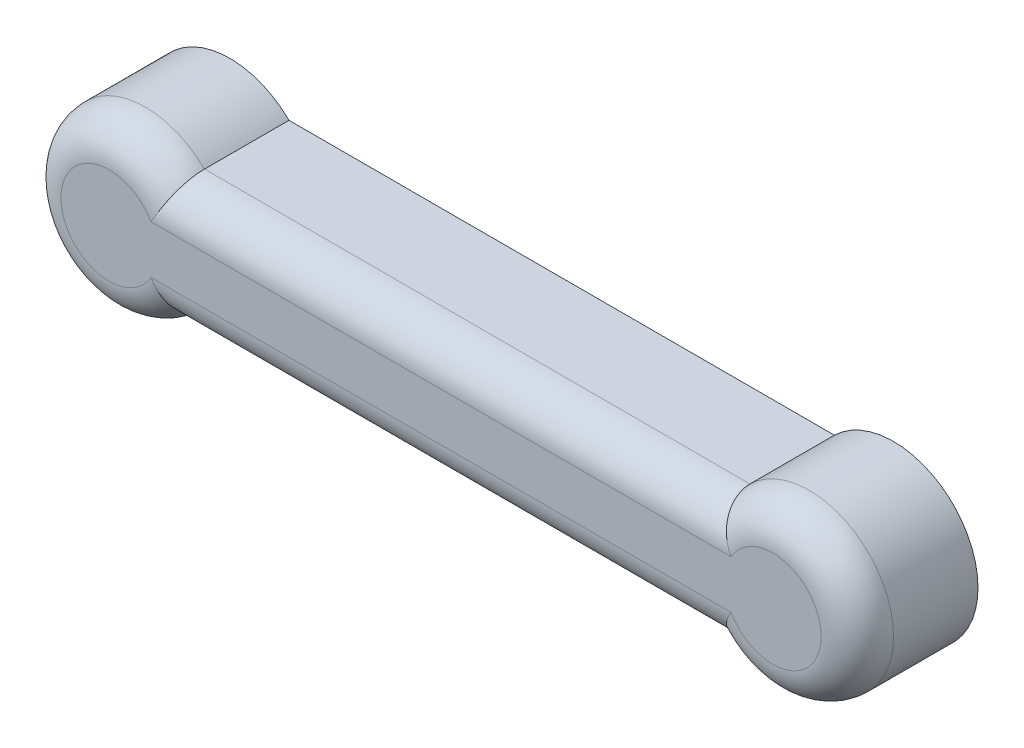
ISO-10303-21;
HEADER;
FILE_DESCRIPTION(('STEP AP214'),'2;1');
FILE_NAME('part.step','',(''),(''),'','','');
FILE_SCHEMA(('AUTOMOTIVE_DESIGN { 1 0 10303 214 1 1 1 1 }'));
ENDSEC;
DATA;
#1=APPLICATION_CONTEXT('core data for automotive mechanical design processes');
#2=APPLICATION_PROTOCOL_DEFINITION('international standard','automotive_design',2000,#1);
#3=PRODUCT_CONTEXT('',#1,'mechanical');
#4=PRODUCT('Part','Part','',(#3));
#5=PRODUCT_RELATED_PRODUCT_CATEGORY('part','',(#4));
#6=PRODUCT_DEFINITION_FORMATION('','',#4);
#7=PRODUCT_DEFINITION_CONTEXT('part definition',#1,'design');
#8=PRODUCT_DEFINITION('design','',#6,#7);
#9=PRODUCT_DEFINITION_SHAPE('','',#8);
#10=(LENGTH_UNIT() NAMED_UNIT(*) SI_UNIT(.MILLI.,.METRE.));
#11=(NAMED_UNIT(*) PLANE_ANGLE_UNIT() SI_UNIT($,.RADIAN.));
#12=(NAMED_UNIT(*) SI_UNIT($,.STERADIAN.) SOLID_ANGLE_UNIT());
#13=UNCERTAINTY_MEASURE_WITH_UNIT(LENGTH_MEASURE(1.E-05),#10,'distance_accuracy_value','');
#14=(GEOMETRIC_REPRESENTATION_CONTEXT(3) GLOBAL_UNCERTAINTY_ASSIGNED_CONTEXT((#13)) GLOBAL_UNIT_ASSIGNED_CONTEXT((#10,
#11,#12)) REPRESENTATION_CONTEXT('',''));
#15=CARTESIAN_POINT('',(0.,0.,0.));
#16=DIRECTION('',(0.,0.,1.));
#17=DIRECTION('',(1.,0.,0.));
#18=AXIS2_PLACEMENT_3D('',#15,#16,#17);
#19=CARTESIAN_POINT('',(-27.5,0.,10.));
#20=DIRECTION('',(0.,0.,-1.));
#21=DIRECTION('',(-1.,0.,0.));
#22=AXIS2_PLACEMENT_3D('',#19,#20,#21);
#23=CYLINDRICAL_SURFACE('',#22,7.00000000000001);
#24=DIRECTION('',(0.,0.,-1.));
#25=VECTOR('',#24,1.);
#26=CARTESIAN_POINT('',(-22.6010205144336,-5.,10.));
#27=LINE('',#26,#25);
#28=CARTESIAN_POINT('',(-22.6010205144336,-5.,7.));
#29=VERTEX_POINT('',#28);
#30=CARTESIAN_POINT('',(-22.6010205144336,-5.,0.));
#31=VERTEX_POINT('',#30);
#32=EDGE_CURVE('E88',#29,#31,#27,.T.);
#33=ORIENTED_EDGE('',*,*,#32,.F.);
#34=CARTESIAN_POINT('',(-27.5,0.,7.));
#35=DIRECTION('',(0.,0.,1.));
#36=DIRECTION('',(1.,0.,0.));
#37=AXIS2_PLACEMENT_3D('',#34,#35,#36);
#38=CIRCLE('',#37,7.00000000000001);
#39=CARTESIAN_POINT('',(-22.6010205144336,4.99999999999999,7.));
#40=VERTEX_POINT('',#39);
#41=EDGE_CURVE('E11',#29,#40,#38,.F.);
#42=ORIENTED_EDGE('',*,*,#41,.T.);
#43=DIRECTION('',(0.,0.,-1.));
#44=VECTOR('',#43,1.);
#45=CARTESIAN_POINT('',(-22.6010205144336,4.99999999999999,10.));
#46=LINE('',#45,#44);
#47=CARTESIAN_POINT('',(-22.6010205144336,4.99999999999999,0.));
#48=VERTEX_POINT('',#47);
#49=EDGE_CURVE('E108',#40,#48,#46,.T.);
#50=ORIENTED_EDGE('',*,*,#49,.T.);
#51=CARTESIAN_POINT('',(-27.5,0.,0.));
#52=DIRECTION('',(0.,0.,1.));
#53=DIRECTION('',(1.,0.,0.));
#54=AXIS2_PLACEMENT_3D('',#51,#52,#53);
#55=CIRCLE('',#54,7.00000000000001);
#56=EDGE_CURVE('E103',#48,#31,#55,.T.);
#57=ORIENTED_EDGE('',*,*,#56,.T.);
#58=EDGE_LOOP('',(#33,#42,#50,#57));
#59=FACE_BOUND('',#58,.T.);
#60=ADVANCED_FACE('F32',(#59),#23,.T.);
#61=CARTESIAN_POINT('',(-22.6010205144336,-5.,10.));
#62=DIRECTION('',(0.,1.,0.));
#63=DIRECTION('',(-1.,0.,0.));
#64=AXIS2_PLACEMENT_3D('',#61,#62,#63);
#65=PLANE('',#64);
#66=DIRECTION('',(0.,0.,-1.));
#67=VECTOR('',#66,1.);
#68=CARTESIAN_POINT('',(22.6010205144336,-4.99999999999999,10.));
#69=LINE('',#68,#67);
#70=CARTESIAN_POINT('',(22.6010205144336,-4.99999999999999,7.));
#71=VERTEX_POINT('',#70);
#72=CARTESIAN_POINT('',(22.6010205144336,-4.99999999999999,0.));
#73=VERTEX_POINT('',#72);
#74=EDGE_CURVE('E97',#71,#73,#69,.T.);
#75=ORIENTED_EDGE('',*,*,#74,.F.);
#76=DIRECTION('',(1.,0.,0.));
#77=VECTOR('',#76,1.);
#78=CARTESIAN_POINT('',(-22.6010205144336,-5.,7.));
#79=LINE('',#78,#77);
#80=EDGE_CURVE('E45',#71,#29,#79,.F.);
#81=ORIENTED_EDGE('',*,*,#80,.T.);
#82=ORIENTED_EDGE('',*,*,#32,.T.);
#83=DIRECTION('',(1.,0.,0.));
#84=VECTOR('',#83,1.);
#85=CARTESIAN_POINT('',(-22.6010205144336,-5.,0.));
#86=LINE('',#85,#84);
#87=EDGE_CURVE('E91',#31,#73,#86,.T.);
#88=ORIENTED_EDGE('',*,*,#87,.T.);
#89=EDGE_LOOP('',(#75,#81,#82,#88));
#90=FACE_BOUND('',#89,.T.);
#91=ADVANCED_FACE('F90',(#90),#65,.F.);
#92=CARTESIAN_POINT('',(27.5,0.,10.));
#93=DIRECTION('',(0.,0.,-1.));
#94=DIRECTION('',(-1.,0.,0.));
#95=AXIS2_PLACEMENT_3D('',#92,#93,#94);
#96=CYLINDRICAL_SURFACE('',#95,7.00000000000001);
#97=DIRECTION('',(0.,0.,-1.));
#98=VECTOR('',#97,1.);
#99=CARTESIAN_POINT('',(22.6010205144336,4.99999999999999,10.));
#100=LINE('',#99,#98);
#101=CARTESIAN_POINT('',(22.6010205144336,4.99999999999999,7.));
#102=VERTEX_POINT('',#101);
#103=CARTESIAN_POINT('',(22.6010205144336,4.99999999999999,0.));
#104=VERTEX_POINT('',#103);
#105=EDGE_CURVE('E121',#102,#104,#100,.T.);
#106=ORIENTED_EDGE('',*,*,#105,.F.);
#107=CARTESIAN_POINT('',(27.5,0.,7.));
#108=DIRECTION('',(0.,0.,1.));
#109=DIRECTION('',(1.,0.,0.));
#110=AXIS2_PLACEMENT_3D('',#107,#108,#109);
#111=CIRCLE('',#110,7.00000000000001);
#112=EDGE_CURVE('E60',#102,#71,#111,.F.);
#113=ORIENTED_EDGE('',*,*,#112,.T.);
#114=ORIENTED_EDGE('',*,*,#74,.T.);
#115=CARTESIAN_POINT('',(27.5,0.,0.));
#116=DIRECTION('',(0.,0.,1.));
#117=DIRECTION('',(-1.,0.,0.));
#118=AXIS2_PLACEMENT_3D('',#115,#116,#117);
#119=CIRCLE('',#118,7.00000000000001);
#120=EDGE_CURVE('E105',#73,#104,#119,.T.);
#121=ORIENTED_EDGE('',*,*,#120,.T.);
#122=EDGE_LOOP('',(#106,#113,#114,#121));
#123=FACE_BOUND('',#122,.T.);
#124=ADVANCED_FACE('F173',(#123),#96,.T.);
#125=CARTESIAN_POINT('',(-22.6010205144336,4.99999999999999,10.));
#126=DIRECTION('',(0.,-1.,0.));
#127=DIRECTION('',(1.,0.,0.));
#128=AXIS2_PLACEMENT_3D('',#125,#126,#127);
#129=PLANE('',#128);
#130=ORIENTED_EDGE('',*,*,#49,.F.);
#131=DIRECTION('',(-1.,0.,0.));
#132=VECTOR('',#131,1.);
#133=CARTESIAN_POINT('',(22.6010205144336,4.99999999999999,7.));
#134=LINE('',#133,#132);
#135=EDGE_CURVE('E132',#40,#102,#134,.F.);
#136=ORIENTED_EDGE('',*,*,#135,.T.);
#137=ORIENTED_EDGE('',*,*,#105,.T.);
#138=DIRECTION('',(-1.,0.,0.));
#139=VECTOR('',#138,1.);
#140=CARTESIAN_POINT('',(-22.6010205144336,4.99999999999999,0.));
#141=LINE('',#140,#139);
#142=EDGE_CURVE('E118',#104,#48,#141,.T.);
#143=ORIENTED_EDGE('',*,*,#142,.T.);
#144=EDGE_LOOP('',(#130,#136,#137,#143));
#145=FACE_BOUND('',#144,.T.);
#146=ADVANCED_FACE('F178',(#145),#129,.F.);
#147=CARTESIAN_POINT('',(-27.5,0.,10.));
#148=DIRECTION('',(0.,0.,1.));
#149=DIRECTION('',(1.,0.,0.));
#150=AXIS2_PLACEMENT_3D('',#147,#148,#149);
#151=PLANE('',#150);
#152=CARTESIAN_POINT('',(27.5,0.,10.));
#153=DIRECTION('',(0.,0.,1.));
#154=DIRECTION('',(1.,0.,0.));
#155=AXIS2_PLACEMENT_3D('',#152,#153,#154);
#156=CIRCLE('',#155,4.00000000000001);
#157=CARTESIAN_POINT('',(24.0358983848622,-1.99999999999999,10.));
#158=VERTEX_POINT('',#157);
#159=CARTESIAN_POINT('',(24.0358983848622,1.99999999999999,10.));
#160=VERTEX_POINT('',#159);
#161=EDGE_CURVE('E127',#158,#160,#156,.T.);
#162=ORIENTED_EDGE('',*,*,#161,.T.);
#163=DIRECTION('',(-1.,0.,0.));
#164=VECTOR('',#163,1.);
#165=CARTESIAN_POINT('',(-22.6010205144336,1.99999999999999,10.));
#166=LINE('',#165,#164);
#167=CARTESIAN_POINT('',(-24.0358983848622,1.99999999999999,10.));
#168=VERTEX_POINT('',#167);
#169=EDGE_CURVE('E129',#160,#168,#166,.T.);
#170=ORIENTED_EDGE('',*,*,#169,.T.);
#171=CARTESIAN_POINT('',(-27.5,0.,10.));
#172=DIRECTION('',(0.,0.,1.));
#173=DIRECTION('',(1.,0.,0.));
#174=AXIS2_PLACEMENT_3D('',#171,#172,#173);
#175=CIRCLE('',#174,4.00000000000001);
#176=CARTESIAN_POINT('',(-24.0358983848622,-2.,10.));
#177=VERTEX_POINT('',#176);
#178=EDGE_CURVE('E96',#168,#177,#175,.T.);
#179=ORIENTED_EDGE('',*,*,#178,.T.);
#180=DIRECTION('',(1.,0.,0.));
#181=VECTOR('',#180,1.);
#182=CARTESIAN_POINT('',(22.6010205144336,-1.99999999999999,10.));
#183=LINE('',#182,#181);
#184=EDGE_CURVE('E125',#177,#158,#183,.T.);
#185=ORIENTED_EDGE('',*,*,#184,.T.);
#186=EDGE_LOOP('',(#162,#170,#179,#185));
#187=FACE_BOUND('',#186,.T.);
#188=ADVANCED_FACE('F181',(#187),#151,.T.);
#189=CARTESIAN_POINT('',(-27.5,0.,0.));
#190=DIRECTION('',(0.,0.,1.));
#191=DIRECTION('',(1.,0.,0.));
#192=AXIS2_PLACEMENT_3D('',#189,#190,#191);
#193=PLANE('',#192);
#194=CARTESIAN_POINT('',(-27.5,0.,0.));
#195=DIRECTION('',(0.,0.,-1.));
#196=DIRECTION('',(-1.,0.,0.));
#197=AXIS2_PLACEMENT_3D('',#194,#195,#196);
#198=CIRCLE('',#197,4.2);
#199=CARTESIAN_POINT('',(-31.7,0.,0.));
#200=VERTEX_POINT('',#199);
#201=EDGE_CURVE('E208',#200,#200,#198,.T.);
#202=ORIENTED_EDGE('',*,*,#201,.F.);
#203=EDGE_LOOP('',(#202));
#204=FACE_BOUND('',#203,.T.);
#205=CARTESIAN_POINT('',(27.5,0.,0.));
#206=DIRECTION('',(0.,0.,-1.));
#207=DIRECTION('',(-1.,0.,0.));
#208=AXIS2_PLACEMENT_3D('',#205,#206,#207);
#209=CIRCLE('',#208,4.2);
#210=CARTESIAN_POINT('',(23.3,0.,0.));
#211=VERTEX_POINT('',#210);
#212=EDGE_CURVE('E113',#211,#211,#209,.T.);
#213=ORIENTED_EDGE('',*,*,#212,.F.);
#214=EDGE_LOOP('',(#213));
#215=FACE_BOUND('',#214,.T.);
#216=ORIENTED_EDGE('',*,*,#56,.F.);
#217=ORIENTED_EDGE('',*,*,#142,.F.);
#218=ORIENTED_EDGE('',*,*,#120,.F.);
#219=ORIENTED_EDGE('',*,*,#87,.F.);
#220=EDGE_LOOP('',(#216,#217,#218,#219));
#221=FACE_BOUND('',#220,.T.);
#222=ADVANCED_FACE('F101',(#204,#215,#221),#193,.F.);
#223=CARTESIAN_POINT('',(27.5,0.,8.));
#224=DIRECTION('',(0.,0.,-1.));
#225=DIRECTION('',(-1.,0.,0.));
#226=AXIS2_PLACEMENT_3D('',#223,#224,#225);
#227=CYLINDRICAL_SURFACE('',#226,4.2);
#228=CARTESIAN_POINT('',(27.5,0.,8.));
#229=DIRECTION('',(0.,0.,-1.));
#230=DIRECTION('',(-1.,0.,0.));
#231=AXIS2_PLACEMENT_3D('',#228,#229,#230);
#232=CIRCLE('',#231,4.2);
#233=CARTESIAN_POINT('',(23.3,0.,8.));
#234=VERTEX_POINT('',#233);
#235=EDGE_CURVE('E110',#234,#234,#232,.T.);
#236=ORIENTED_EDGE('',*,*,#235,.F.);
#237=EDGE_LOOP('',(#236));
#238=FACE_BOUND('',#237,.T.);
#239=ORIENTED_EDGE('',*,*,#212,.T.);
#240=EDGE_LOOP('',(#239));
#241=FACE_BOUND('',#240,.T.);
#242=ADVANCED_FACE('F185',(#238,#241),#227,.F.);
#243=CARTESIAN_POINT('',(27.5,0.,8.));
#244=DIRECTION('',(0.,0.,-1.));
#245=DIRECTION('',(-1.,0.,0.));
#246=AXIS2_PLACEMENT_3D('',#243,#244,#245);
#247=PLANE('',#246);
#248=ORIENTED_EDGE('',*,*,#235,.T.);
#249=EDGE_LOOP('',(#248));
#250=FACE_BOUND('',#249,.T.);
#251=ADVANCED_FACE('F192',(#250),#247,.T.);
#252=CARTESIAN_POINT('',(-27.5,0.,8.));
#253=DIRECTION('',(0.,0.,-1.));
#254=DIRECTION('',(-1.,0.,0.));
#255=AXIS2_PLACEMENT_3D('',#252,#253,#254);
#256=CYLINDRICAL_SURFACE('',#255,4.2);
#257=CARTESIAN_POINT('',(-27.5,0.,8.));
#258=DIRECTION('',(0.,0.,-1.));
#259=DIRECTION('',(-1.,0.,0.));
#260=AXIS2_PLACEMENT_3D('',#257,#258,#259);
#261=CIRCLE('',#260,4.2);
#262=CARTESIAN_POINT('',(-31.7,0.,8.));
#263=VERTEX_POINT('',#262);
#264=EDGE_CURVE('E207',#263,#263,#261,.T.);
#265=ORIENTED_EDGE('',*,*,#264,.F.);
#266=EDGE_LOOP('',(#265));
#267=FACE_BOUND('',#266,.T.);
#268=ORIENTED_EDGE('',*,*,#201,.T.);
#269=EDGE_LOOP('',(#268));
#270=FACE_BOUND('',#269,.T.);
#271=ADVANCED_FACE('F196',(#267,#270),#256,.F.);
#272=CARTESIAN_POINT('',(-27.5,0.,8.));
#273=DIRECTION('',(0.,0.,-1.));
#274=DIRECTION('',(-1.,0.,0.));
#275=AXIS2_PLACEMENT_3D('',#272,#273,#274);
#276=PLANE('',#275);
#277=ORIENTED_EDGE('',*,*,#264,.T.);
#278=EDGE_LOOP('',(#277));
#279=FACE_BOUND('',#278,.T.);
#280=ADVANCED_FACE('F166',(#279),#276,.T.);
#281=CARTESIAN_POINT('',(-27.5,-2.,7.));
#282=DIRECTION('',(-1.,0.,0.));
#283=DIRECTION('',(0.,-1.,0.));
#284=AXIS2_PLACEMENT_3D('',#281,#282,#283);
#285=CYLINDRICAL_SURFACE('',#284,3.);
#286=CARTESIAN_POINT('',(-22.6010205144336,-5.,7.));
#287=CARTESIAN_POINT('',(-22.6010181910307,-5.00001093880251,7.07955253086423));
#288=CARTESIAN_POINT('',(-22.6023123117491,-4.99683589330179,7.15909977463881));
#289=CARTESIAN_POINT('',(-22.6074748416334,-4.98419755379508,7.31759605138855));
#290=CARTESIAN_POINT('',(-22.6113428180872,-4.97473531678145,7.39654518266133));
#291=CARTESIAN_POINT('',(-22.621622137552,-4.94963637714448,7.55309688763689));
#292=CARTESIAN_POINT('',(-22.628027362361,-4.93401452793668,7.63070223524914));
#293=CARTESIAN_POINT('',(-22.6433394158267,-4.89677351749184,7.78418672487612));
#294=CARTESIAN_POINT('',(-22.6522462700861,-4.87515429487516,7.86006584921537));
#295=CARTESIAN_POINT('',(-22.6826541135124,-4.80160076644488,8.08430167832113));
#296=CARTESIAN_POINT('',(-22.707852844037,-4.74094469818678,8.22941596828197));
#297=CARTESIAN_POINT('',(-22.7675534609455,-4.59879093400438,8.5068631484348));
#298=CARTESIAN_POINT('',(-22.8020577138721,-4.51728793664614,8.63919277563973));
#299=CARTESIAN_POINT('',(-22.8807031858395,-4.33408001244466,8.89128075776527));
#300=CARTESIAN_POINT('',(-22.9250664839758,-4.23191543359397,9.01063550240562));
#301=CARTESIAN_POINT('',(-23.0220885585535,-4.01233479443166,9.23039503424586));
#302=CARTESIAN_POINT('',(-23.0747492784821,-3.89491516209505,9.33079536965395));
#303=CARTESIAN_POINT('',(-23.1913380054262,-3.64023699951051,9.51717368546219));
#304=CARTESIAN_POINT('',(-23.2557857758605,-3.50217514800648,9.60172636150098));
#305=CARTESIAN_POINT('',(-23.3922247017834,-3.21729097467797,9.74659150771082));
#306=CARTESIAN_POINT('',(-23.4642205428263,-3.07046323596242,9.80688880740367));
#307=CARTESIAN_POINT('',(-23.6152534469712,-2.77137826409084,9.90341951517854));
#308=CARTESIAN_POINT('',(-23.6943331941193,-2.61909196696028,9.93949413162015));
#309=CARTESIAN_POINT('',(-23.858165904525,-2.314066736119,9.98749625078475));
#310=CARTESIAN_POINT('',(-23.9429081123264,-2.16132915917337,9.99946825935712));
#311=CARTESIAN_POINT('',(-24.0319759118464,-2.00679679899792,9.99999424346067));
#312=CARTESIAN_POINT('',(-24.0339365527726,-2.00339798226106,10.0000000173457));
#313=CARTESIAN_POINT('',(-24.0358983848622,-2.,10.));
#314=B_SPLINE_CURVE_WITH_KNOTS('',3,(#286,#287,#288,#289,#290,#291,#292,#293,#294,#295,#296,
#297,#298,#299,#300,#301,#302,#303,#304,#305,#306,#307,#308,#309,#310,#311,#312,#313),
.UNSPECIFIED.,.F.,.F.,(4,2,2,2,2,2,2,2,2,2,2,2,2,4),(0.,0.23857461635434,0.477109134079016,
0.715071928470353,0.95303715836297,1.42848906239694,1.9040619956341,2.39168800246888,
2.87942839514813,3.39999262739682,3.92088194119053,4.44515344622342,4.96845598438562,
4.98022732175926),.UNSPECIFIED.);
#315=EDGE_CURVE('E215',#29,#177,#314,.T.);
#316=ORIENTED_EDGE('',*,*,#315,.F.);
#317=ORIENTED_EDGE('',*,*,#80,.F.);
#318=CARTESIAN_POINT('',(22.6010205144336,-4.99999999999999,7.));
#319=CARTESIAN_POINT('',(22.6010181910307,-5.0000109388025,7.07955253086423));
#320=CARTESIAN_POINT('',(22.6023123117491,-4.99683589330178,7.15909977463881));
#321=CARTESIAN_POINT('',(22.6074748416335,-4.98419755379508,7.31759605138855));
#322=CARTESIAN_POINT('',(22.6113428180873,-4.97473531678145,7.39654518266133));
#323=CARTESIAN_POINT('',(22.621622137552,-4.94963637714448,7.55309688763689));
#324=CARTESIAN_POINT('',(22.628027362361,-4.93401452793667,7.63070223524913));
#325=CARTESIAN_POINT('',(22.6433394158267,-4.89677351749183,7.78418672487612));
#326=CARTESIAN_POINT('',(22.6522462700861,-4.87515429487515,7.86006584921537));
#327=CARTESIAN_POINT('',(22.6826541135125,-4.80160076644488,8.08430167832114));
#328=CARTESIAN_POINT('',(22.7078528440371,-4.74094469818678,8.22941596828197));
#329=CARTESIAN_POINT('',(22.7675534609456,-4.59879093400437,8.5068631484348));
#330=CARTESIAN_POINT('',(22.8020577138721,-4.51728793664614,8.63919277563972));
#331=CARTESIAN_POINT('',(22.8807031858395,-4.33408001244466,8.89128075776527));
#332=CARTESIAN_POINT('',(22.9250664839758,-4.23191543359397,9.01063550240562));
#333=CARTESIAN_POINT('',(23.0220885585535,-4.01233479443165,9.23039503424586));
#334=CARTESIAN_POINT('',(23.0747492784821,-3.89491516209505,9.33079536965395));
#335=CARTESIAN_POINT('',(23.1913380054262,-3.64023699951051,9.51717368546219));
#336=CARTESIAN_POINT('',(23.2557857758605,-3.50217514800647,9.60172636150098));
#337=CARTESIAN_POINT('',(23.3922247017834,-3.21729097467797,9.74659150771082));
#338=CARTESIAN_POINT('',(23.4642205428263,-3.07046323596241,9.80688880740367));
#339=CARTESIAN_POINT('',(23.6152534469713,-2.77137826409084,9.90341951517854));
#340=CARTESIAN_POINT('',(23.6943331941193,-2.61909196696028,9.93949413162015));
#341=CARTESIAN_POINT('',(23.858165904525,-2.31406673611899,9.98749625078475));
#342=CARTESIAN_POINT('',(23.9429081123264,-2.16132915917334,9.99946825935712));
#343=CARTESIAN_POINT('',(24.0319759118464,-2.00679679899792,9.99999424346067));
#344=CARTESIAN_POINT('',(24.0339365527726,-2.00339798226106,10.0000000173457));
#345=CARTESIAN_POINT('',(24.0358983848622,-1.99999999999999,10.));
#346=B_SPLINE_CURVE_WITH_KNOTS('',3,(#318,#319,#320,#321,#322,#323,#324,#325,#326,#327,#328,
#329,#330,#331,#332,#333,#334,#335,#336,#337,#338,#339,#340,#341,#342,#343,#344,#345),
.UNSPECIFIED.,.F.,.F.,(4,2,2,2,2,2,2,2,2,2,2,2,2,4),(0.,0.23857461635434,0.477109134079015,
0.715071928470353,0.95303715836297,1.42848906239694,1.9040619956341,2.39168800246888,
2.87942839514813,3.39999262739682,3.92088194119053,4.44515344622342,4.96845598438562,
4.98022732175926),.UNSPECIFIED.);
#347=EDGE_CURVE('E37',#158,#71,#346,.F.);
#348=ORIENTED_EDGE('',*,*,#347,.F.);
#349=ORIENTED_EDGE('',*,*,#184,.F.);
#350=EDGE_LOOP('',(#316,#317,#348,#349));
#351=FACE_BOUND('',#350,.T.);
#352=ADVANCED_FACE('F34',(#351),#285,.T.);
#353=CARTESIAN_POINT('',(27.5,0.,7.));
#354=DIRECTION('',(0.,0.,1.));
#355=DIRECTION('',(1.,0.,0.));
#356=AXIS2_PLACEMENT_3D('',#353,#354,#355);
#357=TOROIDAL_SURFACE('',#356,4.00000000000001,3.);
#358=ORIENTED_EDGE('',*,*,#347,.T.);
#359=ORIENTED_EDGE('',*,*,#112,.F.);
#360=CARTESIAN_POINT('',(22.6010205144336,5.,7.));
#361=CARTESIAN_POINT('',(22.6010181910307,5.0000109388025,7.07955253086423));
#362=CARTESIAN_POINT('',(22.6023123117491,4.99683589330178,7.15909977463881));
#363=CARTESIAN_POINT('',(22.6074748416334,4.98419755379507,7.31759605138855));
#364=CARTESIAN_POINT('',(22.6113428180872,4.97473531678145,7.39654518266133));
#365=CARTESIAN_POINT('',(22.621622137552,4.94963637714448,7.55309688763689));
#366=CARTESIAN_POINT('',(22.628027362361,4.93401452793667,7.63070223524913));
#367=CARTESIAN_POINT('',(22.6433394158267,4.89677351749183,7.78418672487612));
#368=CARTESIAN_POINT('',(22.6522462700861,4.87515429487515,7.86006584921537));
#369=CARTESIAN_POINT('',(22.6826541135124,4.80160076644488,8.08430167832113));
#370=CARTESIAN_POINT('',(22.707852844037,4.74094469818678,8.22941596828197));
#371=CARTESIAN_POINT('',(22.7675534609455,4.59879093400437,8.5068631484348));
#372=CARTESIAN_POINT('',(22.8020577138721,4.51728793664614,8.63919277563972));
#373=CARTESIAN_POINT('',(22.8807031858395,4.33408001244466,8.89128075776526));
#374=CARTESIAN_POINT('',(22.9250664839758,4.23191543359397,9.01063550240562));
#375=CARTESIAN_POINT('',(23.0220885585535,4.01233479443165,9.23039503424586));
#376=CARTESIAN_POINT('',(23.0747492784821,3.89491516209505,9.33079536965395));
#377=CARTESIAN_POINT('',(23.1913380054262,3.64023699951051,9.51717368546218));
#378=CARTESIAN_POINT('',(23.2557857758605,3.50217514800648,9.60172636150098));
#379=CARTESIAN_POINT('',(23.3922247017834,3.21729097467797,9.74659150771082));
#380=CARTESIAN_POINT('',(23.4642205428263,3.07046323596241,9.80688880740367));
#381=CARTESIAN_POINT('',(23.6152534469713,2.77137826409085,9.90341951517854));
#382=CARTESIAN_POINT('',(23.6943331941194,2.61909196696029,9.93949413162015));
#383=CARTESIAN_POINT('',(23.858165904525,2.31406673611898,9.98749625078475));
#384=CARTESIAN_POINT('',(23.9429081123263,2.16132915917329,9.99946825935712));
#385=CARTESIAN_POINT('',(24.0319759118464,2.00679679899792,9.99999424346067));
#386=CARTESIAN_POINT('',(24.0339365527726,2.00339798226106,10.0000000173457));
#387=CARTESIAN_POINT('',(24.0358983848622,2.,10.));
#388=B_SPLINE_CURVE_WITH_KNOTS('',3,(#360,#361,#362,#363,#364,#365,#366,#367,#368,#369,#370,
#371,#372,#373,#374,#375,#376,#377,#378,#379,#380,#381,#382,#383,#384,#385,#386,#387),
.UNSPECIFIED.,.F.,.F.,(4,2,2,2,2,2,2,2,2,2,2,2,2,4),(0.,0.23857461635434,0.477109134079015,
0.715071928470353,0.95303715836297,1.42848906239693,1.90406199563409,2.39168800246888,
2.87942839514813,3.39999262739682,3.92088194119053,4.44515344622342,4.96845598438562,
4.98022732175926),.UNSPECIFIED.);
#389=EDGE_CURVE('E144',#160,#102,#388,.F.);
#390=ORIENTED_EDGE('',*,*,#389,.F.);
#391=ORIENTED_EDGE('',*,*,#161,.F.);
#392=EDGE_LOOP('',(#358,#359,#390,#391));
#393=FACE_BOUND('',#392,.T.);
#394=ADVANCED_FACE('F155',(#393),#357,.T.);
#395=CARTESIAN_POINT('',(-27.5,0.,7.));
#396=DIRECTION('',(0.,0.,1.));
#397=DIRECTION('',(1.,0.,0.));
#398=AXIS2_PLACEMENT_3D('',#395,#396,#397);
#399=TOROIDAL_SURFACE('',#398,4.00000000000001,3.);
#400=ORIENTED_EDGE('',*,*,#315,.T.);
#401=ORIENTED_EDGE('',*,*,#178,.F.);
#402=CARTESIAN_POINT('',(-22.6010205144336,4.99999999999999,7.));
#403=CARTESIAN_POINT('',(-22.6010181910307,5.0000109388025,7.07955253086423));
#404=CARTESIAN_POINT('',(-22.602312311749,4.99683589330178,7.15909977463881));
#405=CARTESIAN_POINT('',(-22.6074748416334,4.98419755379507,7.31759605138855));
#406=CARTESIAN_POINT('',(-22.6113428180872,4.97473531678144,7.39654518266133));
#407=CARTESIAN_POINT('',(-22.621622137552,4.94963637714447,7.55309688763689));
#408=CARTESIAN_POINT('',(-22.628027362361,4.93401452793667,7.63070223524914));
#409=CARTESIAN_POINT('',(-22.6433394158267,4.89677351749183,7.78418672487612));
#410=CARTESIAN_POINT('',(-22.652246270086,4.87515429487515,7.86006584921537));
#411=CARTESIAN_POINT('',(-22.6826541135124,4.80160076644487,8.08430167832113));
#412=CARTESIAN_POINT('',(-22.707852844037,4.74094469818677,8.22941596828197));
#413=CARTESIAN_POINT('',(-22.7675534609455,4.59879093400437,8.5068631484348));
#414=CARTESIAN_POINT('',(-22.8020577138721,4.51728793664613,8.63919277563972));
#415=CARTESIAN_POINT('',(-22.8807031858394,4.33408001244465,8.89128075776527));
#416=CARTESIAN_POINT('',(-22.9250664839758,4.23191543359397,9.01063550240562));
#417=CARTESIAN_POINT('',(-23.0220885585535,4.01233479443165,9.23039503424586));
#418=CARTESIAN_POINT('',(-23.0747492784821,3.89491516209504,9.33079536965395));
#419=CARTESIAN_POINT('',(-23.1913380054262,3.6402369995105,9.51717368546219));
#420=CARTESIAN_POINT('',(-23.2557857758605,3.50217514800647,9.60172636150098));
#421=CARTESIAN_POINT('',(-23.3922247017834,3.21729097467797,9.74659150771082));
#422=CARTESIAN_POINT('',(-23.4642205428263,3.07046323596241,9.80688880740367));
#423=CARTESIAN_POINT('',(-23.6152534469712,2.77137826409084,9.90341951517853));
#424=CARTESIAN_POINT('',(-23.6943331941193,2.61909196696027,9.93949413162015));
#425=CARTESIAN_POINT('',(-23.858165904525,2.314066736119,9.98749625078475));
#426=CARTESIAN_POINT('',(-23.9429081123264,2.16132915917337,9.99946825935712));
#427=CARTESIAN_POINT('',(-24.0319759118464,2.00679679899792,9.99999424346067));
#428=CARTESIAN_POINT('',(-24.0339365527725,2.00339798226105,10.0000000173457));
#429=CARTESIAN_POINT('',(-24.0358983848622,1.99999999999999,10.));
#430=B_SPLINE_CURVE_WITH_KNOTS('',3,(#402,#403,#404,#405,#406,#407,#408,#409,#410,#411,#412,
#413,#414,#415,#416,#417,#418,#419,#420,#421,#422,#423,#424,#425,#426,#427,#428,#429),
.UNSPECIFIED.,.F.,.F.,(4,2,2,2,2,2,2,2,2,2,2,2,2,4),(0.,0.23857461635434,0.477109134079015,
0.715071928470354,0.95303715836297,1.42848906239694,1.90406199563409,2.39168800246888,
2.87942839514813,3.39999262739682,3.92088194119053,4.44515344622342,4.96845598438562,
4.98022732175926),.UNSPECIFIED.);
#431=EDGE_CURVE('E137',#40,#168,#430,.T.);
#432=ORIENTED_EDGE('',*,*,#431,.F.);
#433=ORIENTED_EDGE('',*,*,#41,.F.);
#434=EDGE_LOOP('',(#400,#401,#432,#433));
#435=FACE_BOUND('',#434,.T.);
#436=ADVANCED_FACE('F148',(#435),#399,.T.);
#437=CARTESIAN_POINT('',(-27.5,1.99999999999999,7.));
#438=DIRECTION('',(1.,0.,0.));
#439=DIRECTION('',(0.,1.,0.));
#440=AXIS2_PLACEMENT_3D('',#437,#438,#439);
#441=CYLINDRICAL_SURFACE('',#440,3.);
#442=ORIENTED_EDGE('',*,*,#389,.T.);
#443=ORIENTED_EDGE('',*,*,#135,.F.);
#444=ORIENTED_EDGE('',*,*,#431,.T.);
#445=ORIENTED_EDGE('',*,*,#169,.F.);
#446=EDGE_LOOP('',(#442,#443,#444,#445));
#447=FACE_BOUND('',#446,.T.);
#448=ADVANCED_FACE('F151',(#447),#441,.T.);
#449=CLOSED_SHELL('',(#60,#91,#124,#146,#188,#222,#242,#251,#271,#280,#352,#394,#436,#448));
#450=MANIFOLD_SOLID_BREP('B2',#449);
#451=ADVANCED_BREP_SHAPE_REPRESENTATION('',(#18,#450),#14);
#452=SHAPE_DEFINITION_REPRESENTATION(#9,#451);
ENDSEC;
END-ISO-10303-21;
